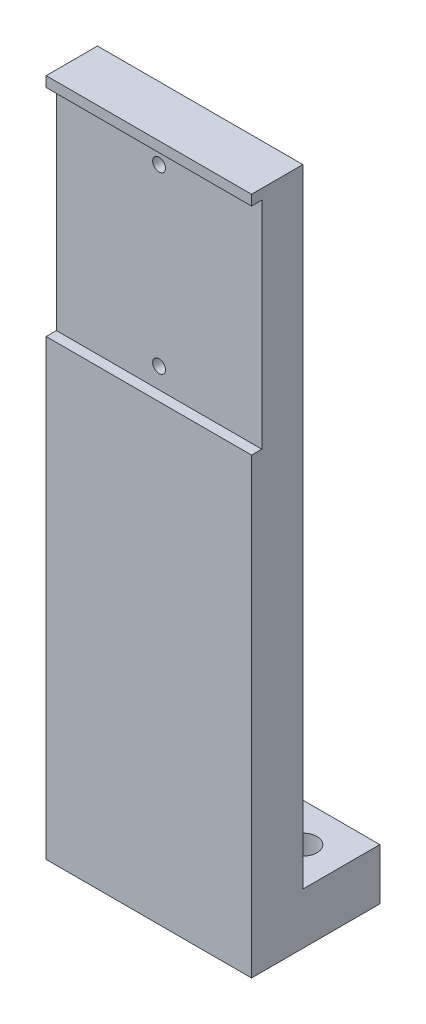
from build123d import *

# Parameters (mm, degrees)
SKETCH_1_W          = 40
SKETCH_1_H          = 132.2
SKETCH_1_R          = 1.25
EXTRUDE_1_DEPTH     = 25
SKETCH_2_OUTSIDE_W  = 55.072
SKETCH_2_OUTSIDE_H  = 162.272
CUT_EXTRUDE_1_DEPTH = 141.363243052
SKETCH_3_R          = 2.75
CUT_EXTRUDE_2_DEPTH = 25


with BuildPart() as part:
    # Sketch 1 → Extrude 1 (new body)
    with BuildSketch(Plane.XY):
        with Locations((20, 66.1)):
            Rectangle(SKETCH_1_W, SKETCH_1_H)
        with Locations((20, 92.2)):
            Circle(SKETCH_1_R, mode=Mode.SUBTRACT)
        with Locations((20, 126.2)):
            Circle(SKETCH_1_R, mode=Mode.SUBTRACT)
    extrude(amount=EXTRUDE_1_DEPTH)

    # Sketch 2 outside → Cut-Extrude 1 (cut, through all)
    with BuildSketch(Plane(origin=(40, 0, 0), x_dir=(0, 0, -1), z_dir=(1, 0, 0))):
        with Locations((-12.5, 66.1)):
            Rectangle(SKETCH_2_OUTSIDE_W, SKETCH_2_OUTSIDE_H)
        Polygon((-23, 88.203720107), (-23, 130.203720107), (-25, 130.203720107), (-25, 132.203720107), (-15, 132.203720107), (-15, 10.003720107), (0, 10.003720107), (0, 0.003720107), (-25, 0.003720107), (-25, 88.203720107), align=None, mode=Mode.SUBTRACT)
    extrude(amount=-CUT_EXTRUDE_1_DEPTH, mode=Mode.SUBTRACT)

    # Sketch 3 → Cut-Extrude 2 (cut)
    with BuildSketch(Plane(origin=(0, 10.003720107, 0), x_dir=(1, 0, 0), z_dir=(0, 1, 0))):
        with Locations(Location((7.5, -7.5, 0), (0, 0, 270))):
            Circle(SKETCH_3_R)
        with Locations(Location((32.5, -7.5, 0), (0, 0, 270))):
            Circle(SKETCH_3_R)
    extrude(amount=-CUT_EXTRUDE_2_DEPTH, mode=Mode.SUBTRACT)


solid = part.part
